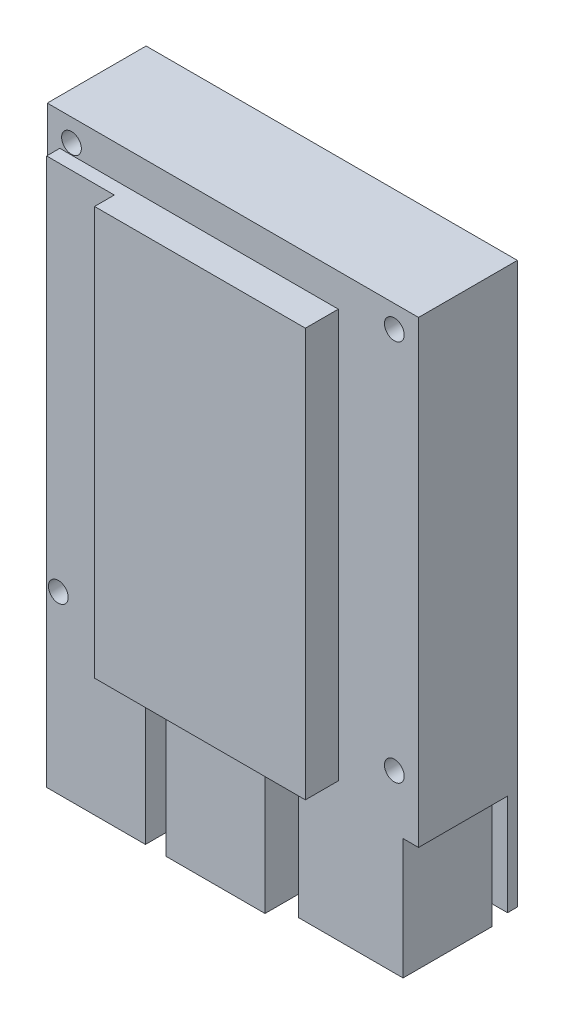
from build123d import *

# Parameters (mm, degrees)
SKETCH1_W           = 56.35
SKETCH1_H           = 85
BOSS_EXTRUDE1_DEPTH = 55.5
CUT_EXTRUDE3_DEPTH  = 117.105867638
CUT_EXTRUDE4_DEPTH  = 18
SKETCH2_4_W         = 10.275
SKETCH2_4_H         = 15.5
SKETCH2_4_W_2       = 4.725
SKETCH2_4_W_3       = 15
SKETCH2_4_W_4       = 6.075
SKETCH2_4_H_2       = 13.5
SKETCH2_4_W_5       = 9.825
BOSS_EXTRUDE2_DEPTH = 3
SKETCH3_W           = 6.5
SKETCH3_H           = 52.5
BOSS_EXTRUDE3_DEPTH = 2.4
SKETCH4_W           = 83.236605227
SKETCH4_H           = 41.384754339
CUT_EXTRUDE5_DEPTH  = 117.105867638
SKETCH6_W           = 56.35
SKETCH6_H           = 69.665906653
BOSS_EXTRUDE4_DEPTH = 13.5
SKETCH5_R           = 1.5
CUT_EXTRUDE6_DEPTH  = 104.924600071
SKETCH7_W           = 101.583675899
SKETCH7_H           = 36.04582048
CUT_EXTRUDE7_DEPTH  = 5


with BuildPart() as part:
    # Sketch1 → Boss-Extrude1 (new body)
    with BuildSketch(Plane.XY):
        with Locations((28.175, 42.5)):
            Rectangle(SKETCH1_W, SKETCH1_H)
    extrude(amount=BOSS_EXTRUDE1_DEPTH)

    # Sketch2 → Cut-Extrude3 (cut, through all)
    with BuildSketch(Plane.XZ):
        with BuildLine():
            Line((5.575, 25.1), (0, 25.1))
            Line((0, 25.1), (0, 0))
            Line((0, 0), (11.575, 0))
            ThreePointArc((11.575, 0), (7.332359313, 1.757359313), (5.575, 6))
            Line((5.575, 6), (5.575, 25.1))
        make_face()
        with BuildLine():
            Line((56.35, 0), (56.35, 25.1))
            Line((56.35, 25.1), (50.775, 25.1))
            Line((50.775, 25.1), (50.775, 6))
            ThreePointArc((50.775, 6), (49.017640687, 1.757359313), (44.775, 0))
            Line((44.775, 0), (56.35, 0))
        make_face()
        Polygon((56.35, 55.5), (44.175, 55.5), (44.175, 50.5), (54, 50.5), (54, 37), (56.35, 37), align=None)
        Polygon((1.9, 37), (1.9, 52.5), (12.175, 52.5), (12.175, 55.5), (0, 55.5), (0, 37), align=None)
    extrude(amount=-CUT_EXTRUDE3_DEPTH, mode=Mode.SUBTRACT)

    # Sketch2_3 → Cut-Extrude4 (cut)
    with BuildSketch(Plane.XZ):
        Polygon((12.175, 55.5), (12.175, 52.5), (16.9, 52.5), (16.9, 37), (20.05, 37), (20.05, 52.5), (35.05, 52.5), (35.05, 37), (38.1, 37), (38.1, 50.5), (44.175, 50.5), (44.175, 55.5), align=None)
    extrude(amount=-CUT_EXTRUDE4_DEPTH, mode=Mode.SUBTRACT)

    # Sketch2_4 → Boss-Extrude2 (add)
    with BuildSketch(Plane.XZ):
        with Locations((7.0375, 44.75)):
            Rectangle(SKETCH2_4_W, SKETCH2_4_H)
        with Locations((14.5375, 44.75)):
            Rectangle(SKETCH2_4_W_2, SKETCH2_4_H)
        with Locations((27.55, 44.75)):
            Rectangle(SKETCH2_4_W_3, SKETCH2_4_H)
        with Locations((41.1375, 43.75)):
            Rectangle(SKETCH2_4_W_4, SKETCH2_4_H_2)
        with Locations((49.0875, 43.75)):
            Rectangle(SKETCH2_4_W_5, SKETCH2_4_H_2)
    extrude(amount=BOSS_EXTRUDE2_DEPTH)

    # Sketch3 → Boss-Extrude3 (add)
    with BuildSketch(Plane.ZY.offset(-1.9)):
        with Locations((40.25, 53.45)):
            Rectangle(SKETCH3_W, SKETCH3_H)
        with Locations((29.75, 53.45)):
            Rectangle(SKETCH3_W, SKETCH3_H)
    extrude(amount=BOSS_EXTRUDE3_DEPTH)

    # Sketch4 → Cut-Extrude5 (cut, through all)
    with BuildSketch(Plane.XZ):
        with Locations((28.392096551, 14.80762283)):
            Rectangle(SKETCH4_W, SKETCH4_H)
    extrude(amount=-CUT_EXTRUDE5_DEPTH, mode=Mode.SUBTRACT)

    # Sketch6 → Boss-Extrude4 (add)
    with BuildSketch(Plane.XY.offset(50.5)):
        with Locations((28.175, 50.167046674)):
            Rectangle(SKETCH6_W, SKETCH6_H)
    extrude(amount=-BOSS_EXTRUDE4_DEPTH)

    # Sketch5 → Cut-Extrude6 (cut, through all)
    with BuildSketch(Plane(origin=(0, 0, 35.5), x_dir=(-1, 0, 0), z_dir=(0, 0, -1))):
        with Locations((-52.675, 81.6)):
            Circle(SKETCH5_R)
        with Locations((-3.675, 81.6)):
            Circle(SKETCH5_R)
        with Locations((-3.675, 23.6)):
            Circle(SKETCH5_R)
        with Locations((-52.675, 23.6)):
            Circle(SKETCH5_R)
    extrude(amount=-CUT_EXTRUDE6_DEPTH, mode=Mode.SUBTRACT)

    # Sketch7 → Cut-Extrude7 (cut)
    with BuildSketch(Plane.XY.offset(55.5)):
        with Locations((37.583210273, 98.02291024)):
            Rectangle(SKETCH7_W, SKETCH7_H)
    extrude(amount=-CUT_EXTRUDE7_DEPTH, mode=Mode.SUBTRACT)


solid = part.part
